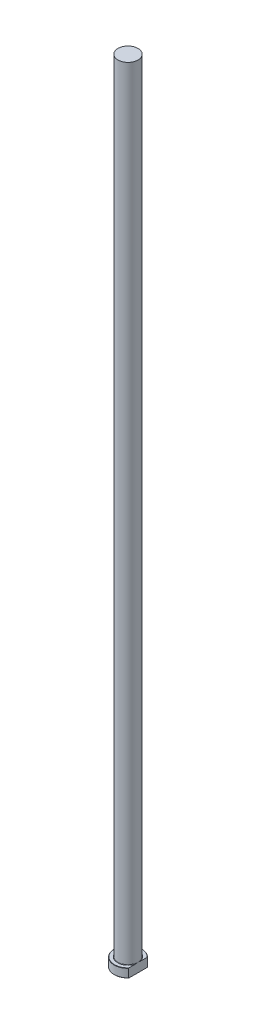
from build123d import *
from build123d.topology import SkipClean

# Parameters (mm, degrees)
CHAMFER1_SIZE = 0.2
FILLET1_R     = 0.3
KEY_DEPTH     = 631.192034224


with BuildPart() as part:
    # Sketch1 → Revolve1 (revolve)
    with BuildSketch(Plane.XY, mode=Mode.PRIVATE) as revolve1_sk:
        Polygon((0, 0), (-11, 0), (-11, 7), (-8, 7), (-8, 630), (0, 630), align=None)
    revolve(revolve1_sk.sketch.rotate(Axis((0, 259.958771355, 0), (0, -1, 0)), 270), axis=Axis((0, 259.958771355, 0), (0, -1, 0)))

    # Chamfer1
    chamfer1_edges = [part.edges().sort_by_distance(p)[0] for p in [
        (0, 7, -11),
        (0, 0, -11),
    ]]
    chamfer(chamfer1_edges, length=CHAMFER1_SIZE)

    # Fillet1
    fillet1_edges = [part.edges().sort_by_distance(p)[0] for p in [
        (0, 7, -8),
    ]]
    fillet(fillet1_edges, radius=FILLET1_R)

    # Sketch2 → KEY (cut, through all)
    with SkipClean():  # the faces are left unmerged after this step: merging them gives an invalid solid
        with BuildSketch(Plane(origin=(0, 0, 0), x_dir=(1, 0, 0), z_dir=(0, 1, 0))):
            with BuildLine():
                Line((8, 7.549834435), (8, -7.549834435))
                ThreePointArc((8, -7.549834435), (11, 0), (8, 7.549834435))
            make_face()
        extrude(amount=KEY_DEPTH, mode=Mode.SUBTRACT)


solid = part.part
